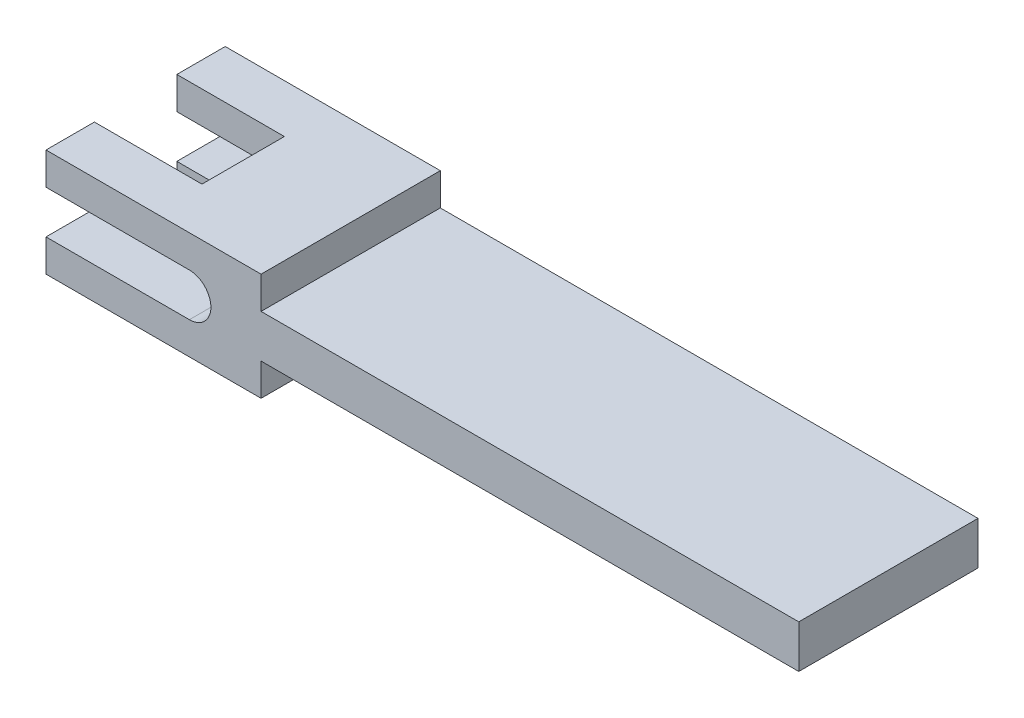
ISO-10303-21;
HEADER;
FILE_DESCRIPTION(('STEP AP214'),'2;1');
FILE_NAME('part.step','',(''),(''),'','','');
FILE_SCHEMA(('AUTOMOTIVE_DESIGN { 1 0 10303 214 1 1 1 1 }'));
ENDSEC;
DATA;
#1=APPLICATION_CONTEXT('core data for automotive mechanical design processes');
#2=APPLICATION_PROTOCOL_DEFINITION('international standard','automotive_design',2000,#1);
#3=PRODUCT_CONTEXT('',#1,'mechanical');
#4=PRODUCT('Part','Part','',(#3));
#5=PRODUCT_RELATED_PRODUCT_CATEGORY('part','',(#4));
#6=PRODUCT_DEFINITION_FORMATION('','',#4);
#7=PRODUCT_DEFINITION_CONTEXT('part definition',#1,'design');
#8=PRODUCT_DEFINITION('design','',#6,#7);
#9=PRODUCT_DEFINITION_SHAPE('','',#8);
#10=(LENGTH_UNIT() NAMED_UNIT(*) SI_UNIT(.MILLI.,.METRE.));
#11=(NAMED_UNIT(*) PLANE_ANGLE_UNIT() SI_UNIT($,.RADIAN.));
#12=(NAMED_UNIT(*) SI_UNIT($,.STERADIAN.) SOLID_ANGLE_UNIT());
#13=UNCERTAINTY_MEASURE_WITH_UNIT(LENGTH_MEASURE(1.E-05),#10,'distance_accuracy_value','');
#14=(GEOMETRIC_REPRESENTATION_CONTEXT(3) GLOBAL_UNCERTAINTY_ASSIGNED_CONTEXT((#13)) GLOBAL_UNIT_ASSIGNED_CONTEXT((#10,
#11,#12)) REPRESENTATION_CONTEXT('',''));
#15=CARTESIAN_POINT('',(0.,0.,0.));
#16=DIRECTION('',(0.,0.,1.));
#17=DIRECTION('',(1.,0.,0.));
#18=AXIS2_PLACEMENT_3D('',#15,#16,#17);
#19=CARTESIAN_POINT('',(20.,15.,25.));
#20=DIRECTION('',(-1.,0.,0.));
#21=DIRECTION('',(0.,0.,1.));
#22=AXIS2_PLACEMENT_3D('',#19,#20,#21);
#23=PLANE('',#22);
#24=DIRECTION('',(0.,0.,1.));
#25=VECTOR('',#24,1.);
#26=CARTESIAN_POINT('',(20.,6.,25.));
#27=LINE('',#26,#25);
#28=CARTESIAN_POINT('',(20.,6.,-25.));
#29=VERTEX_POINT('',#28);
#30=CARTESIAN_POINT('',(20.,6.,25.));
#31=VERTEX_POINT('',#30);
#32=EDGE_CURVE('E525',#29,#31,#27,.T.);
#33=ORIENTED_EDGE('',*,*,#32,.F.);
#34=DIRECTION('',(0.,1.,0.));
#35=VECTOR('',#34,1.);
#36=CARTESIAN_POINT('',(20.,15.,-25.));
#37=LINE('',#36,#35);
#38=CARTESIAN_POINT('',(20.,15.,-25.));
#39=VERTEX_POINT('',#38);
#40=EDGE_CURVE('E515',#29,#39,#37,.T.);
#41=ORIENTED_EDGE('',*,*,#40,.T.);
#42=DIRECTION('',(0.,0.,-1.));
#43=VECTOR('',#42,1.);
#44=CARTESIAN_POINT('',(20.,15.,25.));
#45=LINE('',#44,#43);
#46=CARTESIAN_POINT('',(20.,15.,25.));
#47=VERTEX_POINT('',#46);
#48=EDGE_CURVE('E377',#47,#39,#45,.T.);
#49=ORIENTED_EDGE('',*,*,#48,.F.);
#50=DIRECTION('',(0.,1.,0.));
#51=VECTOR('',#50,1.);
#52=CARTESIAN_POINT('',(20.,15.,25.));
#53=LINE('',#52,#51);
#54=EDGE_CURVE('E385',#31,#47,#53,.T.);
#55=ORIENTED_EDGE('',*,*,#54,.F.);
#56=EDGE_LOOP('',(#33,#41,#49,#55));
#57=FACE_BOUND('',#56,.T.);
#58=ADVANCED_FACE('F369',(#57),#23,.F.);
#59=DIRECTION('',(0.,0.,-1.));
#60=VECTOR('',#59,1.);
#61=CARTESIAN_POINT('',(20.,-6.,25.));
#62=LINE('',#61,#60);
#63=CARTESIAN_POINT('',(20.,-6.,25.));
#64=VERTEX_POINT('',#63);
#65=CARTESIAN_POINT('',(20.,-6.,-25.));
#66=VERTEX_POINT('',#65);
#67=EDGE_CURVE('E393',#64,#66,#62,.T.);
#68=ORIENTED_EDGE('',*,*,#67,.F.);
#69=CARTESIAN_POINT('',(20.,-15.,25.));
#70=VERTEX_POINT('',#69);
#71=EDGE_CURVE('E654',#70,#64,#53,.T.);
#72=ORIENTED_EDGE('',*,*,#71,.F.);
#73=DIRECTION('',(0.,0.,-1.));
#74=VECTOR('',#73,1.);
#75=CARTESIAN_POINT('',(20.,-15.,25.));
#76=LINE('',#75,#74);
#77=CARTESIAN_POINT('',(20.,-15.,-25.));
#78=VERTEX_POINT('',#77);
#79=EDGE_CURVE('E510',#70,#78,#76,.T.);
#80=ORIENTED_EDGE('',*,*,#79,.T.);
#81=EDGE_CURVE('E507',#78,#66,#37,.T.);
#82=ORIENTED_EDGE('',*,*,#81,.T.);
#83=EDGE_LOOP('',(#68,#72,#80,#82));
#84=FACE_BOUND('',#83,.T.);
#85=ADVANCED_FACE('F508',(#84),#23,.F.);
#86=CARTESIAN_POINT('',(-40.,15.,25.));
#87=DIRECTION('',(1.,0.,0.));
#88=DIRECTION('',(0.,1.,0.));
#89=AXIS2_PLACEMENT_3D('',#86,#87,#88);
#90=PLANE('',#89);
#91=DIRECTION('',(0.,0.,-1.));
#92=VECTOR('',#91,1.);
#93=CARTESIAN_POINT('',(-40.,5.99999999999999,25.));
#94=LINE('',#93,#92);
#95=CARTESIAN_POINT('',(-40.,5.99999999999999,-11.5));
#96=VERTEX_POINT('',#95);
#97=CARTESIAN_POINT('',(-40.,5.99999999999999,-25.));
#98=VERTEX_POINT('',#97);
#99=EDGE_CURVE('E624',#96,#98,#94,.T.);
#100=ORIENTED_EDGE('',*,*,#99,.F.);
#101=DIRECTION('',(0.,1.,0.));
#102=VECTOR('',#101,1.);
#103=CARTESIAN_POINT('',(-40.,15.,-11.5));
#104=LINE('',#103,#102);
#105=CARTESIAN_POINT('',(-40.,15.,-11.5));
#106=VERTEX_POINT('',#105);
#107=EDGE_CURVE('E605',#96,#106,#104,.T.);
#108=ORIENTED_EDGE('',*,*,#107,.T.);
#109=DIRECTION('',(0.,0.,-1.));
#110=VECTOR('',#109,1.);
#111=CARTESIAN_POINT('',(-40.,15.,25.));
#112=LINE('',#111,#110);
#113=CARTESIAN_POINT('',(-40.,15.,-25.));
#114=VERTEX_POINT('',#113);
#115=EDGE_CURVE('E620',#106,#114,#112,.T.);
#116=ORIENTED_EDGE('',*,*,#115,.T.);
#117=DIRECTION('',(0.,-1.,0.));
#118=VECTOR('',#117,1.);
#119=CARTESIAN_POINT('',(-40.,15.,-25.));
#120=LINE('',#119,#118);
#121=EDGE_CURVE('E676',#114,#98,#120,.T.);
#122=ORIENTED_EDGE('',*,*,#121,.T.);
#123=EDGE_LOOP('',(#100,#108,#116,#122));
#124=FACE_BOUND('',#123,.T.);
#125=ADVANCED_FACE('F716',(#124),#90,.F.);
#126=CARTESIAN_POINT('',(-40.,-6.,25.));
#127=DIRECTION('',(1.,0.,0.));
#128=DIRECTION('',(0.,1.,0.));
#129=AXIS2_PLACEMENT_3D('',#126,#127,#128);
#130=PLANE('',#129);
#131=DIRECTION('',(0.,0.,-1.));
#132=VECTOR('',#131,1.);
#133=CARTESIAN_POINT('',(-40.,-15.,25.));
#134=LINE('',#133,#132);
#135=CARTESIAN_POINT('',(-40.,-15.,-11.5));
#136=VERTEX_POINT('',#135);
#137=CARTESIAN_POINT('',(-40.,-15.,-25.));
#138=VERTEX_POINT('',#137);
#139=EDGE_CURVE('E638',#136,#138,#134,.T.);
#140=ORIENTED_EDGE('',*,*,#139,.F.);
#141=DIRECTION('',(0.,1.,0.));
#142=VECTOR('',#141,1.);
#143=CARTESIAN_POINT('',(-40.,-6.,-11.5));
#144=LINE('',#143,#142);
#145=CARTESIAN_POINT('',(-40.,-6.,-11.5));
#146=VERTEX_POINT('',#145);
#147=EDGE_CURVE('E596',#136,#146,#144,.T.);
#148=ORIENTED_EDGE('',*,*,#147,.T.);
#149=DIRECTION('',(0.,0.,-1.));
#150=VECTOR('',#149,1.);
#151=CARTESIAN_POINT('',(-40.,-6.,25.));
#152=LINE('',#151,#150);
#153=CARTESIAN_POINT('',(-40.,-6.,-25.));
#154=VERTEX_POINT('',#153);
#155=EDGE_CURVE('E634',#146,#154,#152,.T.);
#156=ORIENTED_EDGE('',*,*,#155,.T.);
#157=DIRECTION('',(0.,-1.,0.));
#158=VECTOR('',#157,1.);
#159=CARTESIAN_POINT('',(-40.,-6.,-25.));
#160=LINE('',#159,#158);
#161=EDGE_CURVE('E663',#154,#138,#160,.T.);
#162=ORIENTED_EDGE('',*,*,#161,.T.);
#163=EDGE_LOOP('',(#140,#148,#156,#162));
#164=FACE_BOUND('',#163,.T.);
#165=ADVANCED_FACE('F774',(#164),#130,.F.);
#166=CARTESIAN_POINT('',(-40.,15.,25.));
#167=DIRECTION('',(0.,-1.,0.));
#168=DIRECTION('',(0.,0.,-1.));
#169=AXIS2_PLACEMENT_3D('',#166,#167,#168);
#170=PLANE('',#169);
#171=ORIENTED_EDGE('',*,*,#115,.F.);
#172=DIRECTION('',(-1.,0.,0.));
#173=VECTOR('',#172,1.);
#174=CARTESIAN_POINT('',(-56.7253308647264,15.,-11.5));
#175=LINE('',#174,#173);
#176=CARTESIAN_POINT('',(-9.99999999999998,15.,-11.5));
#177=VERTEX_POINT('',#176);
#178=EDGE_CURVE('E562',#177,#106,#175,.T.);
#179=ORIENTED_EDGE('',*,*,#178,.F.);
#180=DIRECTION('',(0.,0.,-1.));
#181=VECTOR('',#180,1.);
#182=CARTESIAN_POINT('',(-9.99999999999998,15.,-11.5));
#183=LINE('',#182,#181);
#184=CARTESIAN_POINT('',(-9.99999999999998,15.,11.5));
#185=VERTEX_POINT('',#184);
#186=EDGE_CURVE('E559',#185,#177,#183,.T.);
#187=ORIENTED_EDGE('',*,*,#186,.F.);
#188=DIRECTION('',(1.,0.,0.));
#189=VECTOR('',#188,1.);
#190=CARTESIAN_POINT('',(-56.7253308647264,15.,11.5));
#191=LINE('',#190,#189);
#192=CARTESIAN_POINT('',(-40.,15.,11.5));
#193=VERTEX_POINT('',#192);
#194=EDGE_CURVE('E532',#193,#185,#191,.T.);
#195=ORIENTED_EDGE('',*,*,#194,.F.);
#196=CARTESIAN_POINT('',(-40.,15.,25.));
#197=VERTEX_POINT('',#196);
#198=EDGE_CURVE('E617',#197,#193,#112,.T.);
#199=ORIENTED_EDGE('',*,*,#198,.F.);
#200=DIRECTION('',(-1.,0.,0.));
#201=VECTOR('',#200,1.);
#202=CARTESIAN_POINT('',(-40.,15.,25.));
#203=LINE('',#202,#201);
#204=EDGE_CURVE('E652',#47,#197,#203,.T.);
#205=ORIENTED_EDGE('',*,*,#204,.F.);
#206=ORIENTED_EDGE('',*,*,#48,.T.);
#207=DIRECTION('',(-1.,0.,0.));
#208=VECTOR('',#207,1.);
#209=CARTESIAN_POINT('',(-40.,15.,-25.));
#210=LINE('',#209,#208);
#211=EDGE_CURVE('E514',#39,#114,#210,.T.);
#212=ORIENTED_EDGE('',*,*,#211,.T.);
#213=EDGE_LOOP('',(#171,#179,#187,#195,#199,#205,#206,#212));
#214=FACE_BOUND('',#213,.T.);
#215=ADVANCED_FACE('F686',(#214),#170,.F.);
#216=ORIENTED_EDGE('',*,*,#198,.T.);
#217=DIRECTION('',(0.,-1.,0.));
#218=VECTOR('',#217,1.);
#219=CARTESIAN_POINT('',(-40.,15.,11.5));
#220=LINE('',#219,#218);
#221=CARTESIAN_POINT('',(-40.,5.99999999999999,11.5));
#222=VERTEX_POINT('',#221);
#223=EDGE_CURVE('E587',#193,#222,#220,.T.);
#224=ORIENTED_EDGE('',*,*,#223,.T.);
#225=CARTESIAN_POINT('',(-40.,5.99999999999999,25.));
#226=VERTEX_POINT('',#225);
#227=EDGE_CURVE('E621',#226,#222,#94,.T.);
#228=ORIENTED_EDGE('',*,*,#227,.F.);
#229=DIRECTION('',(0.,-1.,0.));
#230=VECTOR('',#229,1.);
#231=CARTESIAN_POINT('',(-40.,15.,25.));
#232=LINE('',#231,#230);
#233=EDGE_CURVE('E650',#197,#226,#232,.T.);
#234=ORIENTED_EDGE('',*,*,#233,.F.);
#235=EDGE_LOOP('',(#216,#224,#228,#234));
#236=FACE_BOUND('',#235,.T.);
#237=ADVANCED_FACE('F705',(#236),#90,.F.);
#238=CARTESIAN_POINT('',(0.,6.,25.));
#239=DIRECTION('',(0.,1.,0.));
#240=DIRECTION('',(-1.,0.,0.));
#241=AXIS2_PLACEMENT_3D('',#238,#239,#240);
#242=PLANE('',#241);
#243=DIRECTION('',(0.,0.,-1.));
#244=VECTOR('',#243,1.);
#245=CARTESIAN_POINT('',(-9.99999999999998,6.,25.));
#246=LINE('',#245,#244);
#247=CARTESIAN_POINT('',(-9.99999999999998,6.,11.5));
#248=VERTEX_POINT('',#247);
#249=CARTESIAN_POINT('',(-9.99999999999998,6.,-11.5));
#250=VERTEX_POINT('',#249);
#251=EDGE_CURVE('E593',#248,#250,#246,.T.);
#252=ORIENTED_EDGE('',*,*,#251,.T.);
#253=DIRECTION('',(-1.,0.,0.));
#254=VECTOR('',#253,1.);
#255=CARTESIAN_POINT('',(0.,6.,-11.5));
#256=LINE('',#255,#254);
#257=EDGE_CURVE('E602',#250,#96,#256,.T.);
#258=ORIENTED_EDGE('',*,*,#257,.T.);
#259=ORIENTED_EDGE('',*,*,#99,.T.);
#260=DIRECTION('',(1.,0.,0.));
#261=VECTOR('',#260,1.);
#262=CARTESIAN_POINT('',(0.,6.,-25.));
#263=LINE('',#262,#261);
#264=CARTESIAN_POINT('',(0.,6.,-25.));
#265=VERTEX_POINT('',#264);
#266=EDGE_CURVE('E675',#98,#265,#263,.T.);
#267=ORIENTED_EDGE('',*,*,#266,.T.);
#268=DIRECTION('',(0.,0.,-1.));
#269=VECTOR('',#268,1.);
#270=CARTESIAN_POINT('',(0.,6.,25.));
#271=LINE('',#270,#269);
#272=CARTESIAN_POINT('',(0.,6.,25.));
#273=VERTEX_POINT('',#272);
#274=EDGE_CURVE('E625',#273,#265,#271,.T.);
#275=ORIENTED_EDGE('',*,*,#274,.F.);
#276=DIRECTION('',(1.,0.,0.));
#277=VECTOR('',#276,1.);
#278=CARTESIAN_POINT('',(0.,6.,25.));
#279=LINE('',#278,#277);
#280=EDGE_CURVE('E648',#226,#273,#279,.T.);
#281=ORIENTED_EDGE('',*,*,#280,.F.);
#282=ORIENTED_EDGE('',*,*,#227,.T.);
#283=DIRECTION('',(1.,0.,0.));
#284=VECTOR('',#283,1.);
#285=CARTESIAN_POINT('',(0.,6.,11.5));
#286=LINE('',#285,#284);
#287=EDGE_CURVE('E584',#222,#248,#286,.T.);
#288=ORIENTED_EDGE('',*,*,#287,.T.);
#289=EDGE_LOOP('',(#252,#258,#259,#267,#275,#281,#282,#288));
#290=FACE_BOUND('',#289,.T.);
#291=ADVANCED_FACE('F693',(#290),#242,.F.);
#292=CARTESIAN_POINT('',(0.,0.,25.));
#293=DIRECTION('',(0.,0.,-1.));
#294=DIRECTION('',(-1.,0.,0.));
#295=AXIS2_PLACEMENT_3D('',#292,#293,#294);
#296=CYLINDRICAL_SURFACE('',#295,6.);
#297=CARTESIAN_POINT('',(0.,0.,-25.));
#298=DIRECTION('',(0.,0.,-1.));
#299=DIRECTION('',(1.,0.,0.));
#300=AXIS2_PLACEMENT_3D('',#297,#298,#299);
#301=CIRCLE('',#300,6.);
#302=CARTESIAN_POINT('',(0.,-6.,-25.));
#303=VERTEX_POINT('',#302);
#304=EDGE_CURVE('E671',#265,#303,#301,.T.);
#305=ORIENTED_EDGE('',*,*,#304,.T.);
#306=DIRECTION('',(0.,0.,-1.));
#307=VECTOR('',#306,1.);
#308=CARTESIAN_POINT('',(0.,-6.,25.));
#309=LINE('',#308,#307);
#310=CARTESIAN_POINT('',(0.,-6.,25.));
#311=VERTEX_POINT('',#310);
#312=EDGE_CURVE('E628',#311,#303,#309,.T.);
#313=ORIENTED_EDGE('',*,*,#312,.F.);
#314=CARTESIAN_POINT('',(0.,0.,25.));
#315=DIRECTION('',(0.,0.,-1.));
#316=DIRECTION('',(1.,0.,0.));
#317=AXIS2_PLACEMENT_3D('',#314,#315,#316);
#318=CIRCLE('',#317,6.);
#319=EDGE_CURVE('E646',#273,#311,#318,.T.);
#320=ORIENTED_EDGE('',*,*,#319,.F.);
#321=ORIENTED_EDGE('',*,*,#274,.T.);
#322=EDGE_LOOP('',(#305,#313,#320,#321));
#323=FACE_BOUND('',#322,.T.);
#324=ADVANCED_FACE('F697',(#323),#296,.F.);
#325=CARTESIAN_POINT('',(0.,-6.,25.));
#326=DIRECTION('',(0.,-1.,0.));
#327=DIRECTION('',(0.,0.,-1.));
#328=AXIS2_PLACEMENT_3D('',#325,#326,#327);
#329=PLANE('',#328);
#330=ORIENTED_EDGE('',*,*,#155,.F.);
#331=DIRECTION('',(1.,0.,0.));
#332=VECTOR('',#331,1.);
#333=CARTESIAN_POINT('',(0.,-6.,-11.5));
#334=LINE('',#333,#332);
#335=CARTESIAN_POINT('',(-9.99999999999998,-6.,-11.5));
#336=VERTEX_POINT('',#335);
#337=EDGE_CURVE('E599',#146,#336,#334,.T.);
#338=ORIENTED_EDGE('',*,*,#337,.T.);
#339=DIRECTION('',(0.,0.,1.));
#340=VECTOR('',#339,1.);
#341=CARTESIAN_POINT('',(-9.99999999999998,-6.,25.));
#342=LINE('',#341,#340);
#343=CARTESIAN_POINT('',(-9.99999999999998,-6.,11.5));
#344=VERTEX_POINT('',#343);
#345=EDGE_CURVE('E590',#336,#344,#342,.T.);
#346=ORIENTED_EDGE('',*,*,#345,.T.);
#347=DIRECTION('',(-1.,0.,0.));
#348=VECTOR('',#347,1.);
#349=CARTESIAN_POINT('',(0.,-6.,11.5));
#350=LINE('',#349,#348);
#351=CARTESIAN_POINT('',(-40.,-6.,11.5));
#352=VERTEX_POINT('',#351);
#353=EDGE_CURVE('E581',#344,#352,#350,.T.);
#354=ORIENTED_EDGE('',*,*,#353,.T.);
#355=CARTESIAN_POINT('',(-40.,-6.,25.));
#356=VERTEX_POINT('',#355);
#357=EDGE_CURVE('E631',#356,#352,#152,.T.);
#358=ORIENTED_EDGE('',*,*,#357,.F.);
#359=DIRECTION('',(-1.,0.,0.));
#360=VECTOR('',#359,1.);
#361=CARTESIAN_POINT('',(0.,-6.,25.));
#362=LINE('',#361,#360);
#363=EDGE_CURVE('E644',#311,#356,#362,.T.);
#364=ORIENTED_EDGE('',*,*,#363,.F.);
#365=ORIENTED_EDGE('',*,*,#312,.T.);
#366=DIRECTION('',(-1.,0.,0.));
#367=VECTOR('',#366,1.);
#368=CARTESIAN_POINT('',(0.,-6.,-25.));
#369=LINE('',#368,#367);
#370=EDGE_CURVE('E666',#303,#154,#369,.T.);
#371=ORIENTED_EDGE('',*,*,#370,.T.);
#372=EDGE_LOOP('',(#330,#338,#346,#354,#358,#364,#365,#371));
#373=FACE_BOUND('',#372,.T.);
#374=ADVANCED_FACE('F772',(#373),#329,.F.);
#375=ORIENTED_EDGE('',*,*,#357,.T.);
#376=DIRECTION('',(0.,-1.,0.));
#377=VECTOR('',#376,1.);
#378=CARTESIAN_POINT('',(-40.,-6.,11.5));
#379=LINE('',#378,#377);
#380=CARTESIAN_POINT('',(-40.,-15.,11.5));
#381=VERTEX_POINT('',#380);
#382=EDGE_CURVE('E574',#352,#381,#379,.T.);
#383=ORIENTED_EDGE('',*,*,#382,.T.);
#384=CARTESIAN_POINT('',(-40.,-15.,25.));
#385=VERTEX_POINT('',#384);
#386=EDGE_CURVE('E635',#385,#381,#134,.T.);
#387=ORIENTED_EDGE('',*,*,#386,.F.);
#388=DIRECTION('',(0.,-1.,0.));
#389=VECTOR('',#388,1.);
#390=CARTESIAN_POINT('',(-40.,-6.,25.));
#391=LINE('',#390,#389);
#392=EDGE_CURVE('E642',#356,#385,#391,.T.);
#393=ORIENTED_EDGE('',*,*,#392,.F.);
#394=EDGE_LOOP('',(#375,#383,#387,#393));
#395=FACE_BOUND('',#394,.T.);
#396=ADVANCED_FACE('F769',(#395),#130,.F.);
#397=CARTESIAN_POINT('',(-40.,-15.,25.));
#398=DIRECTION('',(0.,1.,0.));
#399=DIRECTION('',(0.,0.,1.));
#400=AXIS2_PLACEMENT_3D('',#397,#398,#399);
#401=PLANE('',#400);
#402=DIRECTION('',(0.,0.,-1.));
#403=VECTOR('',#402,1.);
#404=CARTESIAN_POINT('',(-9.99999999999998,-15.,-11.5));
#405=LINE('',#404,#403);
#406=CARTESIAN_POINT('',(-9.99999999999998,-15.,11.5));
#407=VERTEX_POINT('',#406);
#408=CARTESIAN_POINT('',(-9.99999999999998,-15.,-11.5));
#409=VERTEX_POINT('',#408);
#410=EDGE_CURVE('E564',#407,#409,#405,.T.);
#411=ORIENTED_EDGE('',*,*,#410,.T.);
#412=DIRECTION('',(-1.,0.,0.));
#413=VECTOR('',#412,1.);
#414=CARTESIAN_POINT('',(-56.7253308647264,-15.,-11.5));
#415=LINE('',#414,#413);
#416=EDGE_CURVE('E567',#409,#136,#415,.T.);
#417=ORIENTED_EDGE('',*,*,#416,.T.);
#418=ORIENTED_EDGE('',*,*,#139,.T.);
#419=DIRECTION('',(1.,0.,0.));
#420=VECTOR('',#419,1.);
#421=CARTESIAN_POINT('',(-40.,-15.,-25.));
#422=LINE('',#421,#420);
#423=EDGE_CURVE('E657',#138,#78,#422,.T.);
#424=ORIENTED_EDGE('',*,*,#423,.T.);
#425=ORIENTED_EDGE('',*,*,#79,.F.);
#426=DIRECTION('',(1.,0.,0.));
#427=VECTOR('',#426,1.);
#428=CARTESIAN_POINT('',(-40.,-15.,25.));
#429=LINE('',#428,#427);
#430=EDGE_CURVE('E640',#385,#70,#429,.T.);
#431=ORIENTED_EDGE('',*,*,#430,.F.);
#432=ORIENTED_EDGE('',*,*,#386,.T.);
#433=DIRECTION('',(1.,0.,0.));
#434=VECTOR('',#433,1.);
#435=CARTESIAN_POINT('',(-40.,-15.,11.5));
#436=LINE('',#435,#434);
#437=EDGE_CURVE('E11',#381,#407,#436,.T.);
#438=ORIENTED_EDGE('',*,*,#437,.T.);
#439=EDGE_LOOP('',(#411,#417,#418,#424,#425,#431,#432,#438));
#440=FACE_BOUND('',#439,.T.);
#441=ADVANCED_FACE('F764',(#440),#401,.F.);
#442=CARTESIAN_POINT('',(0.,0.,25.));
#443=DIRECTION('',(0.,0.,1.));
#444=DIRECTION('',(1.,0.,0.));
#445=AXIS2_PLACEMENT_3D('',#442,#443,#444);
#446=PLANE('',#445);
#447=ORIENTED_EDGE('',*,*,#71,.T.);
#448=DIRECTION('',(-1.,0.,0.));
#449=VECTOR('',#448,1.);
#450=CARTESIAN_POINT('',(170.,-6.,25.));
#451=LINE('',#450,#449);
#452=CARTESIAN_POINT('',(170.,-6.,25.));
#453=VERTEX_POINT('',#452);
#454=EDGE_CURVE('E524',#453,#64,#451,.T.);
#455=ORIENTED_EDGE('',*,*,#454,.F.);
#456=DIRECTION('',(0.,-1.,0.));
#457=VECTOR('',#456,1.);
#458=CARTESIAN_POINT('',(170.,6.,25.));
#459=LINE('',#458,#457);
#460=CARTESIAN_POINT('',(170.,6.,25.));
#461=VERTEX_POINT('',#460);
#462=EDGE_CURVE('E545',#461,#453,#459,.T.);
#463=ORIENTED_EDGE('',*,*,#462,.F.);
#464=DIRECTION('',(-1.,0.,0.));
#465=VECTOR('',#464,1.);
#466=CARTESIAN_POINT('',(170.,6.,25.));
#467=LINE('',#466,#465);
#468=EDGE_CURVE('E535',#461,#31,#467,.T.);
#469=ORIENTED_EDGE('',*,*,#468,.T.);
#470=ORIENTED_EDGE('',*,*,#54,.T.);
#471=ORIENTED_EDGE('',*,*,#204,.T.);
#472=ORIENTED_EDGE('',*,*,#233,.T.);
#473=ORIENTED_EDGE('',*,*,#280,.T.);
#474=ORIENTED_EDGE('',*,*,#319,.T.);
#475=ORIENTED_EDGE('',*,*,#363,.T.);
#476=ORIENTED_EDGE('',*,*,#392,.T.);
#477=ORIENTED_EDGE('',*,*,#430,.T.);
#478=EDGE_LOOP('',(#447,#455,#463,#469,#470,#471,#472,#473,#474,#475,#476,#477));
#479=FACE_BOUND('',#478,.T.);
#480=ADVANCED_FACE('F700',(#479),#446,.T.);
#481=CARTESIAN_POINT('',(0.,0.,-25.));
#482=DIRECTION('',(0.,0.,1.));
#483=DIRECTION('',(1.,0.,0.));
#484=AXIS2_PLACEMENT_3D('',#481,#482,#483);
#485=PLANE('',#484);
#486=ORIENTED_EDGE('',*,*,#81,.F.);
#487=ORIENTED_EDGE('',*,*,#423,.F.);
#488=ORIENTED_EDGE('',*,*,#161,.F.);
#489=ORIENTED_EDGE('',*,*,#370,.F.);
#490=ORIENTED_EDGE('',*,*,#304,.F.);
#491=ORIENTED_EDGE('',*,*,#266,.F.);
#492=ORIENTED_EDGE('',*,*,#121,.F.);
#493=ORIENTED_EDGE('',*,*,#211,.F.);
#494=ORIENTED_EDGE('',*,*,#40,.F.);
#495=DIRECTION('',(-1.,0.,0.));
#496=VECTOR('',#495,1.);
#497=CARTESIAN_POINT('',(170.,6.,-25.));
#498=LINE('',#497,#496);
#499=CARTESIAN_POINT('',(170.,6.,-25.));
#500=VERTEX_POINT('',#499);
#501=EDGE_CURVE('E530',#500,#29,#498,.T.);
#502=ORIENTED_EDGE('',*,*,#501,.F.);
#503=DIRECTION('',(0.,1.,0.));
#504=VECTOR('',#503,1.);
#505=CARTESIAN_POINT('',(170.,6.,-25.));
#506=LINE('',#505,#504);
#507=CARTESIAN_POINT('',(170.,-6.,-25.));
#508=VERTEX_POINT('',#507);
#509=EDGE_CURVE('E529',#508,#500,#506,.T.);
#510=ORIENTED_EDGE('',*,*,#509,.F.);
#511=DIRECTION('',(-1.,0.,0.));
#512=VECTOR('',#511,1.);
#513=CARTESIAN_POINT('',(170.,-6.,-25.));
#514=LINE('',#513,#512);
#515=EDGE_CURVE('E521',#508,#66,#514,.T.);
#516=ORIENTED_EDGE('',*,*,#515,.T.);
#517=EDGE_LOOP('',(#486,#487,#488,#489,#490,#491,#492,#493,#494,#502,#510,#516));
#518=FACE_BOUND('',#517,.T.);
#519=ADVANCED_FACE('F527',(#518),#485,.F.);
#520=CARTESIAN_POINT('',(-56.7253308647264,-15.,11.5));
#521=DIRECTION('',(0.,0.,1.));
#522=DIRECTION('',(1.,0.,0.));
#523=AXIS2_PLACEMENT_3D('',#520,#521,#522);
#524=PLANE('',#523);
#525=DIRECTION('',(0.,1.,0.));
#526=VECTOR('',#525,1.);
#527=CARTESIAN_POINT('',(-9.99999999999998,-15.,11.5));
#528=LINE('',#527,#526);
#529=EDGE_CURVE('E576',#407,#344,#528,.T.);
#530=ORIENTED_EDGE('',*,*,#529,.F.);
#531=ORIENTED_EDGE('',*,*,#437,.F.);
#532=ORIENTED_EDGE('',*,*,#382,.F.);
#533=ORIENTED_EDGE('',*,*,#353,.F.);
#534=EDGE_LOOP('',(#530,#531,#532,#533));
#535=FACE_BOUND('',#534,.T.);
#536=ADVANCED_FACE('F752',(#535),#524,.F.);
#537=CARTESIAN_POINT('',(-9.99999999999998,-15.,-11.5));
#538=DIRECTION('',(1.,0.,0.));
#539=DIRECTION('',(0.,0.,-1.));
#540=AXIS2_PLACEMENT_3D('',#537,#538,#539);
#541=PLANE('',#540);
#542=DIRECTION('',(0.,1.,0.));
#543=VECTOR('',#542,1.);
#544=CARTESIAN_POINT('',(-9.99999999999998,-15.,-11.5));
#545=LINE('',#544,#543);
#546=EDGE_CURVE('E571',#409,#336,#545,.T.);
#547=ORIENTED_EDGE('',*,*,#546,.F.);
#548=ORIENTED_EDGE('',*,*,#410,.F.);
#549=ORIENTED_EDGE('',*,*,#529,.T.);
#550=ORIENTED_EDGE('',*,*,#345,.F.);
#551=EDGE_LOOP('',(#547,#548,#549,#550));
#552=FACE_BOUND('',#551,.T.);
#553=ADVANCED_FACE('F726',(#552),#541,.F.);
#554=CARTESIAN_POINT('',(-56.7253308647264,-15.,-11.5));
#555=DIRECTION('',(0.,0.,-1.));
#556=DIRECTION('',(-1.,0.,0.));
#557=AXIS2_PLACEMENT_3D('',#554,#555,#556);
#558=PLANE('',#557);
#559=ORIENTED_EDGE('',*,*,#147,.F.);
#560=ORIENTED_EDGE('',*,*,#416,.F.);
#561=ORIENTED_EDGE('',*,*,#546,.T.);
#562=ORIENTED_EDGE('',*,*,#337,.F.);
#563=EDGE_LOOP('',(#559,#560,#561,#562));
#564=FACE_BOUND('',#563,.T.);
#565=ADVANCED_FACE('F719',(#564),#558,.F.);
#566=ORIENTED_EDGE('',*,*,#257,.F.);
#567=EDGE_CURVE('E575',#250,#177,#545,.T.);
#568=ORIENTED_EDGE('',*,*,#567,.T.);
#569=ORIENTED_EDGE('',*,*,#178,.T.);
#570=ORIENTED_EDGE('',*,*,#107,.F.);
#571=EDGE_LOOP('',(#566,#568,#569,#570));
#572=FACE_BOUND('',#571,.T.);
#573=ADVANCED_FACE('F717',(#572),#558,.F.);
#574=EDGE_CURVE('E570',#248,#185,#528,.T.);
#575=ORIENTED_EDGE('',*,*,#574,.T.);
#576=ORIENTED_EDGE('',*,*,#186,.T.);
#577=ORIENTED_EDGE('',*,*,#567,.F.);
#578=ORIENTED_EDGE('',*,*,#251,.F.);
#579=EDGE_LOOP('',(#575,#576,#577,#578));
#580=FACE_BOUND('',#579,.T.);
#581=ADVANCED_FACE('F713',(#580),#541,.F.);
#582=ORIENTED_EDGE('',*,*,#194,.T.);
#583=ORIENTED_EDGE('',*,*,#574,.F.);
#584=ORIENTED_EDGE('',*,*,#287,.F.);
#585=ORIENTED_EDGE('',*,*,#223,.F.);
#586=EDGE_LOOP('',(#582,#583,#584,#585));
#587=FACE_BOUND('',#586,.T.);
#588=ADVANCED_FACE('F709',(#587),#524,.F.);
#589=CARTESIAN_POINT('',(170.,-6.,25.));
#590=DIRECTION('',(0.,1.,0.));
#591=DIRECTION('',(0.,0.,1.));
#592=AXIS2_PLACEMENT_3D('',#589,#590,#591);
#593=PLANE('',#592);
#594=ORIENTED_EDGE('',*,*,#67,.T.);
#595=ORIENTED_EDGE('',*,*,#515,.F.);
#596=DIRECTION('',(0.,0.,-1.));
#597=VECTOR('',#596,1.);
#598=CARTESIAN_POINT('',(170.,-6.,25.));
#599=LINE('',#598,#597);
#600=EDGE_CURVE('E552',#453,#508,#599,.T.);
#601=ORIENTED_EDGE('',*,*,#600,.F.);
#602=ORIENTED_EDGE('',*,*,#454,.T.);
#603=EDGE_LOOP('',(#594,#595,#601,#602));
#604=FACE_BOUND('',#603,.T.);
#605=ADVANCED_FACE('F520',(#604),#593,.F.);
#606=CARTESIAN_POINT('',(170.,6.,25.));
#607=DIRECTION('',(0.,-1.,0.));
#608=DIRECTION('',(0.,0.,-1.));
#609=AXIS2_PLACEMENT_3D('',#606,#607,#608);
#610=PLANE('',#609);
#611=ORIENTED_EDGE('',*,*,#32,.T.);
#612=ORIENTED_EDGE('',*,*,#468,.F.);
#613=DIRECTION('',(0.,0.,1.));
#614=VECTOR('',#613,1.);
#615=CARTESIAN_POINT('',(170.,6.,25.));
#616=LINE('',#615,#614);
#617=EDGE_CURVE('E555',#500,#461,#616,.T.);
#618=ORIENTED_EDGE('',*,*,#617,.F.);
#619=ORIENTED_EDGE('',*,*,#501,.T.);
#620=EDGE_LOOP('',(#611,#612,#618,#619));
#621=FACE_BOUND('',#620,.T.);
#622=ADVANCED_FACE('F737',(#621),#610,.F.);
#623=CARTESIAN_POINT('',(170.,-6.,25.));
#624=DIRECTION('',(1.,0.,0.));
#625=DIRECTION('',(0.,0.,-1.));
#626=AXIS2_PLACEMENT_3D('',#623,#624,#625);
#627=PLANE('',#626);
#628=ORIENTED_EDGE('',*,*,#462,.T.);
#629=ORIENTED_EDGE('',*,*,#600,.T.);
#630=ORIENTED_EDGE('',*,*,#509,.T.);
#631=ORIENTED_EDGE('',*,*,#617,.T.);
#632=EDGE_LOOP('',(#628,#629,#630,#631));
#633=FACE_BOUND('',#632,.T.);
#634=ADVANCED_FACE('F740',(#633),#627,.T.);
#635=CLOSED_SHELL('',(#58,#85,#125,#165,#215,#237,#291,#324,#374,#396,#441,#480,#519,#536,#553,
#565,#573,#581,#588,#605,#622,#634));
#636=MANIFOLD_SOLID_BREP('B2',#635);
#637=ADVANCED_BREP_SHAPE_REPRESENTATION('',(#18,#636),#14);
#638=SHAPE_DEFINITION_REPRESENTATION(#9,#637);
ENDSEC;
END-ISO-10303-21;
